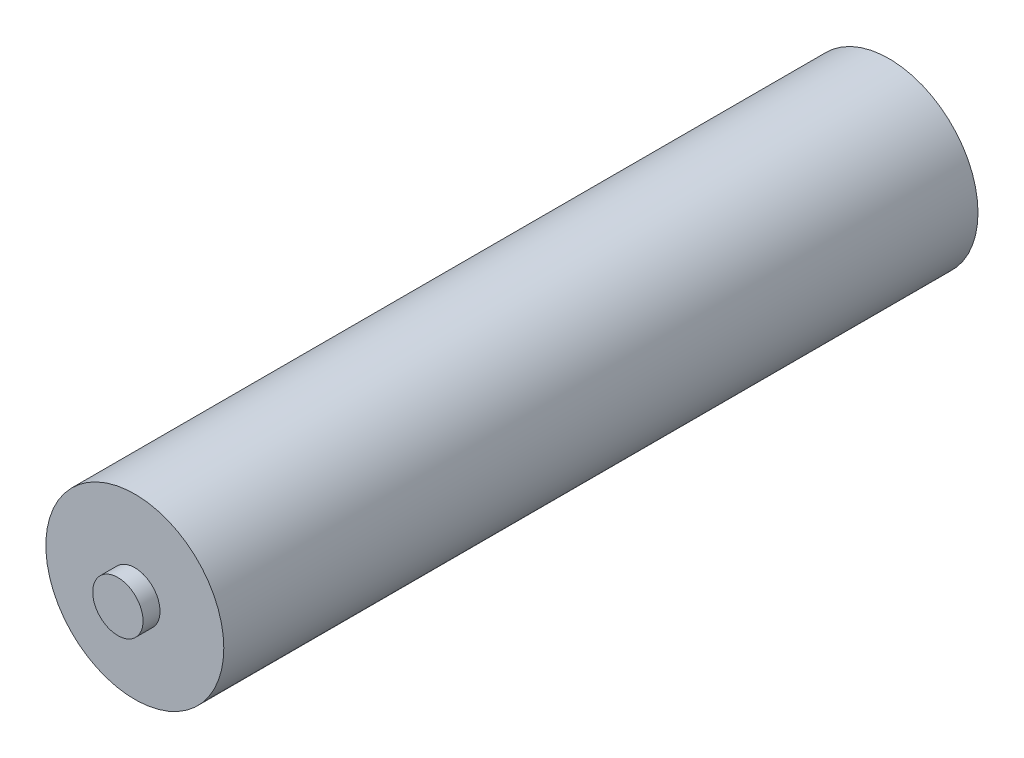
from build123d import *

# Parameters (mm, degrees)
SKETCH_1_R      = 5.25
EXTRUDE_1_DEPTH = 44.5
SKETCH_2_R      = 1.484706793
EXTRUDE_2_DEPTH = 1


with BuildPart() as part:
    # Sketch 1 → Extrude 1 (new body)
    with BuildSketch(Plane.XY):
        Circle(SKETCH_1_R)
    extrude(amount=EXTRUDE_1_DEPTH)

    # Sketch 2 → Extrude 2 (add)
    with BuildSketch(Plane.XY.offset(44.5)):
        Circle(SKETCH_2_R)
    extrude(amount=EXTRUDE_2_DEPTH)


solid = part.part
